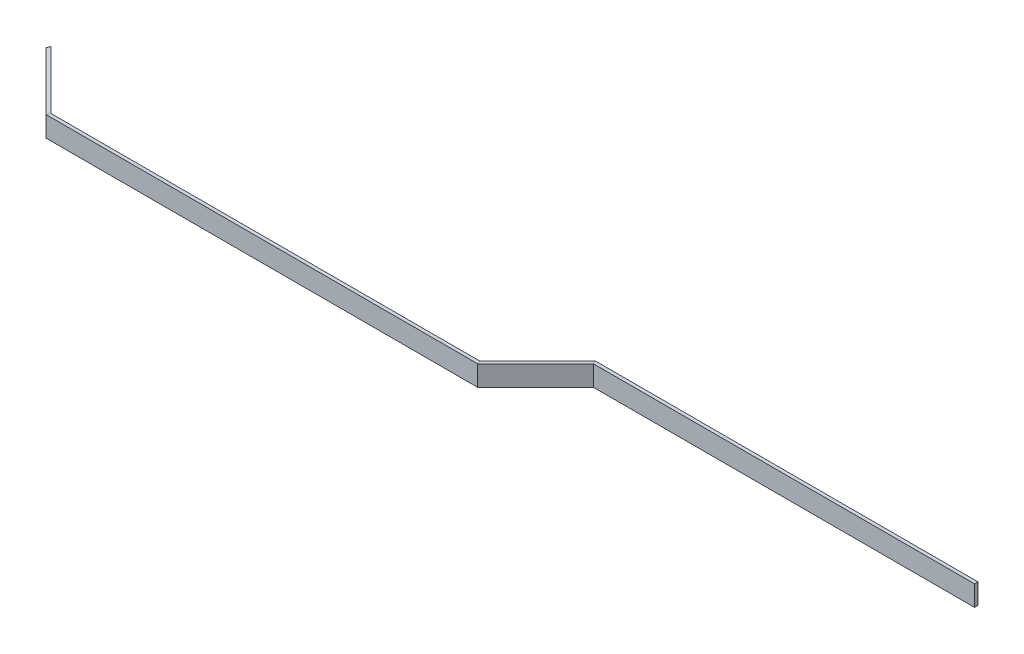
from build123d import *

# Parameters (mm, degrees)
SKETCH2_W           = 6.35
SKETCH2_H           = 38.1
SKETCH6_W           = 6.35
SKETCH6_H           = 38.1
CUT_EXTRUDE1_DEPTH  = 708.569744
SKETCH5_W           = 6.35
SKETCH5_H           = 38.1
BOSS_EXTRUDE2_DEPTH = 2.54
CUT_EXTRUDE3_DEPTH  = 1228.091455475


with BuildPart() as part:
    # Sweep1: sweep along a path in Sketch1
    with BuildLine(Plane(origin=(0, 0, 0), x_dir=(1, 0, 0), z_dir=(0, 1, 0))) as sweep1_path:
        Line((-1219.2, 107.95), (-508, 107.95))
        Line((-508, 107.95), (-400.05, 0))
        Line((-400.05, 0), (400.05, 0))
        Line((400.05, 0), (508, 107.95))
        Line((508, 107.95), (1219.2, 107.95))
    # Sketch2 → Sweep1 (sweep)
    with BuildSketch(Plane(origin=(-1219.2, 0, 0), x_dir=(0, 0, -1), z_dir=(1, 0, 0))):
        with Locations((104.775, -19.05)):
            Rectangle(SKETCH2_W, SKETCH2_H)
    sweep(path=sweep1_path.line, transition=Transition.RIGHT)

    # Sketch6 → Cut-Extrude1 (cut)
    with BuildSketch(Plane.ZY.offset(1219.2)):
        with Locations((-104.775, -19.05)):
            Rectangle(SKETCH6_W, SKETCH6_H)
    extrude(amount=-CUT_EXTRUDE1_DEPTH, mode=Mode.SUBTRACT)

    # Sketch5 → Boss-Extrude2 (add)
    with BuildSketch(Plane(origin=(1219.2, 0, 0), x_dir=(0, 0, -1), z_dir=(1, 0, 0))):
        with Locations((104.775, -19.05)):
            Rectangle(SKETCH5_W, SKETCH5_H)
    extrude(amount=BOSS_EXTRUDE2_DEPTH)

    # Sketch7 → Cut-Extrude3 (cut, through all)
    with BuildSketch(Plane.XZ.offset(38.1)):
        Polygon((-510.630256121, -101.6), (-508, -107.95), (-510.630256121, -107.95), align=None)
    extrude(amount=-CUT_EXTRUDE3_DEPTH, mode=Mode.SUBTRACT)


solid = part.part
